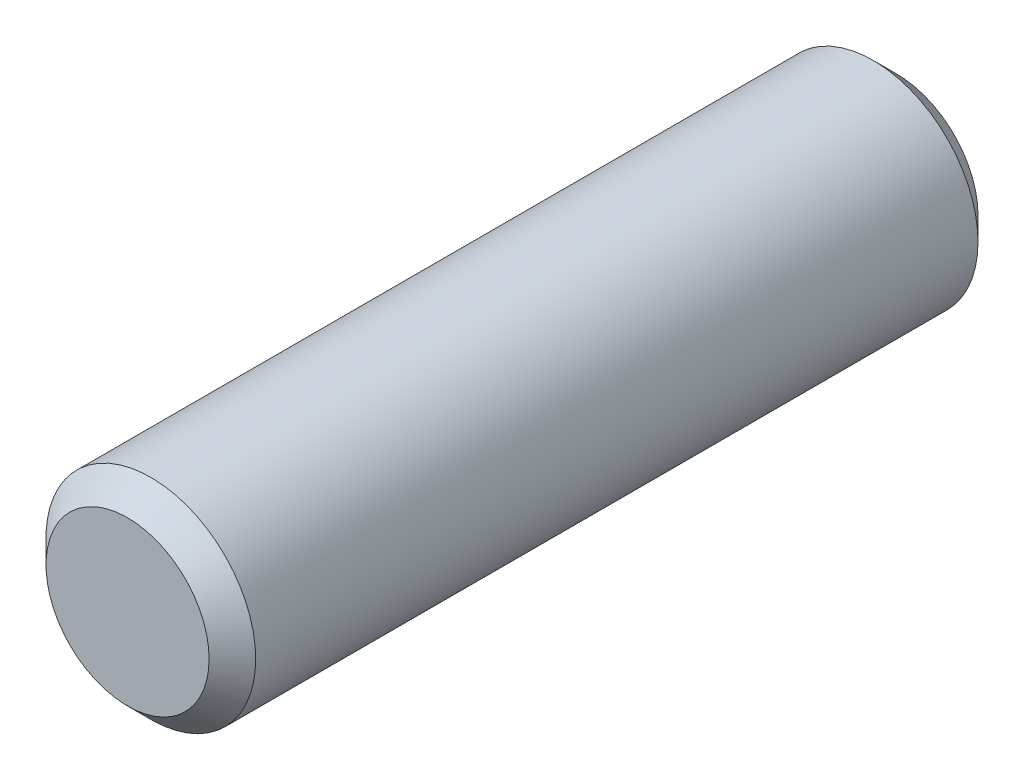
ISO-10303-21;
HEADER;
FILE_DESCRIPTION(('STEP AP214'),'2;1');
FILE_NAME('part.step','',(''),(''),'','','');
FILE_SCHEMA(('AUTOMOTIVE_DESIGN { 1 0 10303 214 1 1 1 1 }'));
ENDSEC;
DATA;
#1=APPLICATION_CONTEXT('core data for automotive mechanical design processes');
#2=APPLICATION_PROTOCOL_DEFINITION('international standard','automotive_design',2000,#1);
#3=PRODUCT_CONTEXT('',#1,'mechanical');
#4=PRODUCT('Part','Part','',(#3));
#5=PRODUCT_RELATED_PRODUCT_CATEGORY('part','',(#4));
#6=PRODUCT_DEFINITION_FORMATION('','',#4);
#7=PRODUCT_DEFINITION_CONTEXT('part definition',#1,'design');
#8=PRODUCT_DEFINITION('design','',#6,#7);
#9=PRODUCT_DEFINITION_SHAPE('','',#8);
#10=(LENGTH_UNIT() NAMED_UNIT(*) SI_UNIT(.MILLI.,.METRE.));
#11=(NAMED_UNIT(*) PLANE_ANGLE_UNIT() SI_UNIT($,.RADIAN.));
#12=(NAMED_UNIT(*) SI_UNIT($,.STERADIAN.) SOLID_ANGLE_UNIT());
#13=UNCERTAINTY_MEASURE_WITH_UNIT(LENGTH_MEASURE(1.E-05),#10,'distance_accuracy_value','');
#14=(GEOMETRIC_REPRESENTATION_CONTEXT(3) GLOBAL_UNCERTAINTY_ASSIGNED_CONTEXT((#13)) GLOBAL_UNIT_ASSIGNED_CONTEXT((#10,
#11,#12)) REPRESENTATION_CONTEXT('',''));
#15=CARTESIAN_POINT('',(0.,0.,0.));
#16=DIRECTION('',(0.,0.,1.));
#17=DIRECTION('',(1.,0.,0.));
#18=AXIS2_PLACEMENT_3D('',#15,#16,#17);
#19=CARTESIAN_POINT('',(0.,0.,16.5));
#20=DIRECTION('',(0.,0.,-1.));
#21=DIRECTION('',(-1.,0.,0.));
#22=AXIS2_PLACEMENT_3D('',#19,#20,#21);
#23=CYLINDRICAL_SURFACE('',#22,4.5);
#24=CARTESIAN_POINT('',(0.,0.,15.5));
#25=DIRECTION('',(0.,0.,1.));
#26=DIRECTION('',(1.,0.,0.));
#27=AXIS2_PLACEMENT_3D('',#24,#25,#26);
#28=CIRCLE('',#27,4.5);
#29=CARTESIAN_POINT('',(4.5,0.,15.5));
#30=VERTEX_POINT('',#29);
#31=EDGE_CURVE('E34',#30,#30,#28,.F.);
#32=ORIENTED_EDGE('',*,*,#31,.T.);
#33=EDGE_LOOP('',(#32));
#34=FACE_BOUND('',#33,.T.);
#35=CARTESIAN_POINT('',(0.,0.,-15.5));
#36=DIRECTION('',(0.,0.,1.));
#37=DIRECTION('',(1.,0.,0.));
#38=AXIS2_PLACEMENT_3D('',#35,#36,#37);
#39=CIRCLE('',#38,4.5);
#40=CARTESIAN_POINT('',(4.5,0.,-15.5));
#41=VERTEX_POINT('',#40);
#42=EDGE_CURVE('E38',#41,#41,#39,.T.);
#43=ORIENTED_EDGE('',*,*,#42,.T.);
#44=EDGE_LOOP('',(#43));
#45=FACE_BOUND('',#44,.T.);
#46=ADVANCED_FACE('F28',(#34,#45),#23,.T.);
#47=CARTESIAN_POINT('',(0.,0.,16.5));
#48=DIRECTION('',(0.,0.,1.));
#49=DIRECTION('',(1.,0.,0.));
#50=AXIS2_PLACEMENT_3D('',#47,#48,#49);
#51=PLANE('',#50);
#52=CARTESIAN_POINT('',(0.,0.,16.5));
#53=DIRECTION('',(0.,0.,1.));
#54=DIRECTION('',(1.,0.,0.));
#55=AXIS2_PLACEMENT_3D('',#52,#53,#54);
#56=CIRCLE('',#55,3.5);
#57=CARTESIAN_POINT('',(3.5,0.,16.5));
#58=VERTEX_POINT('',#57);
#59=EDGE_CURVE('E42',#58,#58,#56,.T.);
#60=ORIENTED_EDGE('',*,*,#59,.T.);
#61=EDGE_LOOP('',(#60));
#62=FACE_BOUND('',#61,.T.);
#63=ADVANCED_FACE('F48',(#62),#51,.T.);
#64=CARTESIAN_POINT('',(0.,0.,-16.5));
#65=DIRECTION('',(0.,0.,1.));
#66=DIRECTION('',(1.,0.,0.));
#67=AXIS2_PLACEMENT_3D('',#64,#65,#66);
#68=PLANE('',#67);
#69=CARTESIAN_POINT('',(0.,0.,-16.5));
#70=DIRECTION('',(0.,0.,1.));
#71=DIRECTION('',(1.,0.,0.));
#72=AXIS2_PLACEMENT_3D('',#69,#70,#71);
#73=CIRCLE('',#72,3.5);
#74=CARTESIAN_POINT('',(3.5,0.,-16.5));
#75=VERTEX_POINT('',#74);
#76=EDGE_CURVE('E10',#75,#75,#73,.F.);
#77=ORIENTED_EDGE('',*,*,#76,.T.);
#78=EDGE_LOOP('',(#77));
#79=FACE_BOUND('',#78,.T.);
#80=ADVANCED_FACE('F53',(#79),#68,.F.);
#81=CARTESIAN_POINT('',(0.,0.,16.5));
#82=DIRECTION('',(0.,0.,-1.));
#83=DIRECTION('',(-1.,0.,0.));
#84=AXIS2_PLACEMENT_3D('',#81,#82,#83);
#85=CONICAL_SURFACE('',#84,3.5,0.785398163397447);
#86=ORIENTED_EDGE('',*,*,#31,.F.);
#87=EDGE_LOOP('',(#86));
#88=FACE_BOUND('',#87,.T.);
#89=ORIENTED_EDGE('',*,*,#59,.F.);
#90=EDGE_LOOP('',(#89));
#91=FACE_BOUND('',#90,.T.);
#92=ADVANCED_FACE('F50',(#88,#91),#85,.T.);
#93=CARTESIAN_POINT('',(0.,0.,-15.5));
#94=DIRECTION('',(0.,0.,1.));
#95=DIRECTION('',(1.,0.,0.));
#96=AXIS2_PLACEMENT_3D('',#93,#94,#95);
#97=CONICAL_SURFACE('',#96,4.5,0.78539816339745);
#98=ORIENTED_EDGE('',*,*,#76,.F.);
#99=EDGE_LOOP('',(#98));
#100=FACE_BOUND('',#99,.T.);
#101=ORIENTED_EDGE('',*,*,#42,.F.);
#102=EDGE_LOOP('',(#101));
#103=FACE_BOUND('',#102,.T.);
#104=ADVANCED_FACE('F52',(#100,#103),#97,.T.);
#105=CLOSED_SHELL('',(#46,#63,#80,#92,#104));
#106=MANIFOLD_SOLID_BREP('B2',#105);
#107=ADVANCED_BREP_SHAPE_REPRESENTATION('',(#18,#106),#14);
#108=SHAPE_DEFINITION_REPRESENTATION(#9,#107);
ENDSEC;
END-ISO-10303-21;
